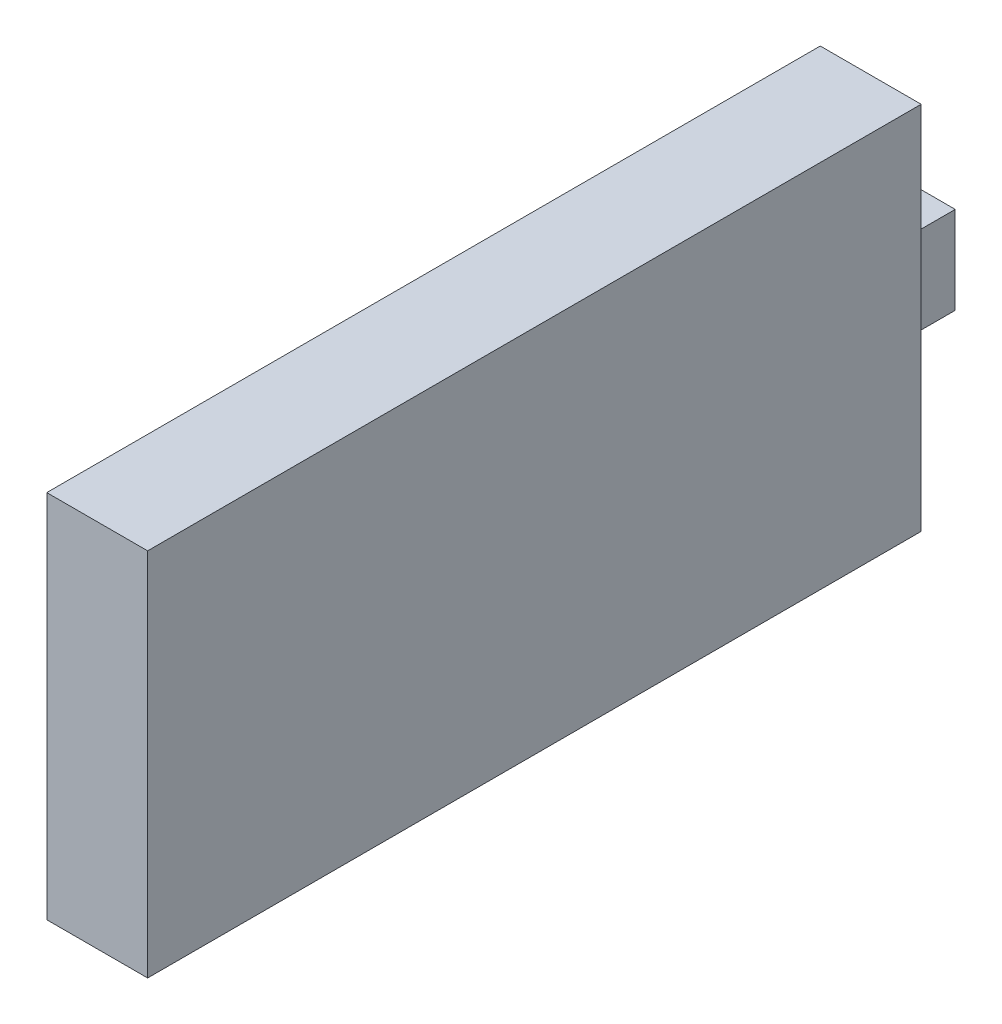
ISO-10303-21;
HEADER;
FILE_DESCRIPTION(('STEP AP214'),'2;1');
FILE_NAME('part.step','',(''),(''),'','','');
FILE_SCHEMA(('AUTOMOTIVE_DESIGN { 1 0 10303 214 1 1 1 1 }'));
ENDSEC;
DATA;
#1=APPLICATION_CONTEXT('core data for automotive mechanical design processes');
#2=APPLICATION_PROTOCOL_DEFINITION('international standard','automotive_design',2000,#1);
#3=PRODUCT_CONTEXT('',#1,'mechanical');
#4=PRODUCT('Part','Part','',(#3));
#5=PRODUCT_RELATED_PRODUCT_CATEGORY('part','',(#4));
#6=PRODUCT_DEFINITION_FORMATION('','',#4);
#7=PRODUCT_DEFINITION_CONTEXT('part definition',#1,'design');
#8=PRODUCT_DEFINITION('design','',#6,#7);
#9=PRODUCT_DEFINITION_SHAPE('','',#8);
#10=(LENGTH_UNIT() NAMED_UNIT(*) SI_UNIT(.MILLI.,.METRE.));
#11=(NAMED_UNIT(*) PLANE_ANGLE_UNIT() SI_UNIT($,.RADIAN.));
#12=(NAMED_UNIT(*) SI_UNIT($,.STERADIAN.) SOLID_ANGLE_UNIT());
#13=UNCERTAINTY_MEASURE_WITH_UNIT(LENGTH_MEASURE(1.E-05),#10,'distance_accuracy_value','');
#14=(GEOMETRIC_REPRESENTATION_CONTEXT(3) GLOBAL_UNCERTAINTY_ASSIGNED_CONTEXT((#13)) GLOBAL_UNIT_ASSIGNED_CONTEXT((#10,
#11,#12)) REPRESENTATION_CONTEXT('',''));
#15=CARTESIAN_POINT('',(0.,0.,0.));
#16=DIRECTION('',(0.,0.,1.));
#17=DIRECTION('',(1.,0.,0.));
#18=AXIS2_PLACEMENT_3D('',#15,#16,#17);
#19=CARTESIAN_POINT('',(-57.0515585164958,55.,-57.5));
#20=DIRECTION('',(0.,0.,1.));
#21=DIRECTION('',(1.,0.,0.));
#22=AXIS2_PLACEMENT_3D('',#19,#20,#21);
#23=PLANE('',#22);
#24=DIRECTION('',(-1.,0.,0.));
#25=VECTOR('',#24,1.);
#26=CARTESIAN_POINT('',(-57.0515585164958,0.,-57.5));
#27=LINE('',#26,#25);
#28=CARTESIAN_POINT('',(-57.0515585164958,0.,-57.5));
#29=VERTEX_POINT('',#28);
#30=CARTESIAN_POINT('',(-72.0515585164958,0.,-57.5));
#31=VERTEX_POINT('',#30);
#32=EDGE_CURVE('E137',#29,#31,#27,.T.);
#33=ORIENTED_EDGE('',*,*,#32,.T.);
#34=DIRECTION('',(0.,-1.,0.));
#35=VECTOR('',#34,1.);
#36=CARTESIAN_POINT('',(-72.0515585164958,55.,-57.5));
#37=LINE('',#36,#35);
#38=CARTESIAN_POINT('',(-72.0515585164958,55.,-57.5));
#39=VERTEX_POINT('',#38);
#40=EDGE_CURVE('E43',#39,#31,#37,.T.);
#41=ORIENTED_EDGE('',*,*,#40,.F.);
#42=DIRECTION('',(-1.,0.,0.));
#43=VECTOR('',#42,1.);
#44=CARTESIAN_POINT('',(-57.0515585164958,55.,-57.5));
#45=LINE('',#44,#43);
#46=CARTESIAN_POINT('',(-57.0515585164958,55.,-57.5));
#47=VERTEX_POINT('',#46);
#48=EDGE_CURVE('E87',#47,#39,#45,.T.);
#49=ORIENTED_EDGE('',*,*,#48,.F.);
#50=DIRECTION('',(0.,-1.,0.));
#51=VECTOR('',#50,1.);
#52=CARTESIAN_POINT('',(-57.0515585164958,55.,-57.5));
#53=LINE('',#52,#51);
#54=EDGE_CURVE('E11',#47,#29,#53,.T.);
#55=ORIENTED_EDGE('',*,*,#54,.T.);
#56=EDGE_LOOP('',(#33,#41,#49,#55));
#57=FACE_BOUND('',#56,.T.);
#58=DIRECTION('',(-1.,0.,0.));
#59=VECTOR('',#58,1.);
#60=CARTESIAN_POINT('',(-61.9817309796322,21.,-57.5));
#61=LINE('',#60,#59);
#62=CARTESIAN_POINT('',(-61.9817309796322,21.,-57.5));
#63=VERTEX_POINT('',#62);
#64=CARTESIAN_POINT('',(-70.9817309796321,21.,-57.5));
#65=VERTEX_POINT('',#64);
#66=EDGE_CURVE('E132',#63,#65,#61,.T.);
#67=ORIENTED_EDGE('',*,*,#66,.F.);
#68=DIRECTION('',(0.,1.,0.));
#69=VECTOR('',#68,1.);
#70=CARTESIAN_POINT('',(-61.9817309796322,21.,-57.5));
#71=LINE('',#70,#69);
#72=CARTESIAN_POINT('',(-61.9817309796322,34.,-57.5));
#73=VERTEX_POINT('',#72);
#74=EDGE_CURVE('E128',#63,#73,#71,.T.);
#75=ORIENTED_EDGE('',*,*,#74,.T.);
#76=DIRECTION('',(-1.,0.,0.));
#77=VECTOR('',#76,1.);
#78=CARTESIAN_POINT('',(-61.9817309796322,34.,-57.5));
#79=LINE('',#78,#77);
#80=CARTESIAN_POINT('',(-70.9817309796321,34.,-57.5));
#81=VERTEX_POINT('',#80);
#82=EDGE_CURVE('E50',#73,#81,#79,.T.);
#83=ORIENTED_EDGE('',*,*,#82,.T.);
#84=DIRECTION('',(0.,1.,0.));
#85=VECTOR('',#84,1.);
#86=CARTESIAN_POINT('',(-70.9817309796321,21.,-57.5));
#87=LINE('',#86,#85);
#88=EDGE_CURVE('E186',#65,#81,#87,.T.);
#89=ORIENTED_EDGE('',*,*,#88,.F.);
#90=EDGE_LOOP('',(#67,#75,#83,#89));
#91=FACE_BOUND('',#90,.T.);
#92=ADVANCED_FACE('F35',(#57,#91),#23,.F.);
#93=CARTESIAN_POINT('',(-57.0515585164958,55.,-57.5));
#94=DIRECTION('',(-1.,0.,0.));
#95=DIRECTION('',(0.,0.,1.));
#96=AXIS2_PLACEMENT_3D('',#93,#94,#95);
#97=PLANE('',#96);
#98=DIRECTION('',(0.,0.,-1.));
#99=VECTOR('',#98,1.);
#100=CARTESIAN_POINT('',(-57.0515585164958,0.,-57.5));
#101=LINE('',#100,#99);
#102=CARTESIAN_POINT('',(-57.0515585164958,0.,57.5));
#103=VERTEX_POINT('',#102);
#104=EDGE_CURVE('E134',#103,#29,#101,.T.);
#105=ORIENTED_EDGE('',*,*,#104,.T.);
#106=ORIENTED_EDGE('',*,*,#54,.F.);
#107=DIRECTION('',(0.,0.,-1.));
#108=VECTOR('',#107,1.);
#109=CARTESIAN_POINT('',(-57.0515585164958,55.,-57.5));
#110=LINE('',#109,#108);
#111=CARTESIAN_POINT('',(-57.0515585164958,55.,57.5));
#112=VERTEX_POINT('',#111);
#113=EDGE_CURVE('E143',#112,#47,#110,.T.);
#114=ORIENTED_EDGE('',*,*,#113,.F.);
#115=DIRECTION('',(0.,-1.,0.));
#116=VECTOR('',#115,1.);
#117=CARTESIAN_POINT('',(-57.0515585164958,55.,57.5));
#118=LINE('',#117,#116);
#119=EDGE_CURVE('E148',#112,#103,#118,.T.);
#120=ORIENTED_EDGE('',*,*,#119,.T.);
#121=EDGE_LOOP('',(#105,#106,#114,#120));
#122=FACE_BOUND('',#121,.T.);
#123=ADVANCED_FACE('F37',(#122),#97,.F.);
#124=CARTESIAN_POINT('',(-72.0515585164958,55.,-57.5));
#125=DIRECTION('',(1.,0.,0.));
#126=DIRECTION('',(0.,0.,-1.));
#127=AXIS2_PLACEMENT_3D('',#124,#125,#126);
#128=PLANE('',#127);
#129=DIRECTION('',(0.,0.,1.));
#130=VECTOR('',#129,1.);
#131=CARTESIAN_POINT('',(-72.0515585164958,0.,-57.5));
#132=LINE('',#131,#130);
#133=CARTESIAN_POINT('',(-72.0515585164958,0.,57.5));
#134=VERTEX_POINT('',#133);
#135=EDGE_CURVE('E151',#31,#134,#132,.T.);
#136=ORIENTED_EDGE('',*,*,#135,.T.);
#137=DIRECTION('',(0.,-1.,0.));
#138=VECTOR('',#137,1.);
#139=CARTESIAN_POINT('',(-72.0515585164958,55.,57.5));
#140=LINE('',#139,#138);
#141=CARTESIAN_POINT('',(-72.0515585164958,55.,57.5));
#142=VERTEX_POINT('',#141);
#143=EDGE_CURVE('E155',#142,#134,#140,.T.);
#144=ORIENTED_EDGE('',*,*,#143,.F.);
#145=DIRECTION('',(0.,0.,1.));
#146=VECTOR('',#145,1.);
#147=CARTESIAN_POINT('',(-72.0515585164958,55.,-57.5));
#148=LINE('',#147,#146);
#149=EDGE_CURVE('E146',#39,#142,#148,.T.);
#150=ORIENTED_EDGE('',*,*,#149,.F.);
#151=ORIENTED_EDGE('',*,*,#40,.T.);
#152=EDGE_LOOP('',(#136,#144,#150,#151));
#153=FACE_BOUND('',#152,.T.);
#154=ADVANCED_FACE('F160',(#153),#128,.F.);
#155=CARTESIAN_POINT('',(-57.0515585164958,55.,57.5));
#156=DIRECTION('',(0.,0.,-1.));
#157=DIRECTION('',(-1.,0.,0.));
#158=AXIS2_PLACEMENT_3D('',#155,#156,#157);
#159=PLANE('',#158);
#160=DIRECTION('',(1.,0.,0.));
#161=VECTOR('',#160,1.);
#162=CARTESIAN_POINT('',(-57.0515585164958,0.,57.5));
#163=LINE('',#162,#161);
#164=EDGE_CURVE('E80',#134,#103,#163,.T.);
#165=ORIENTED_EDGE('',*,*,#164,.T.);
#166=ORIENTED_EDGE('',*,*,#119,.F.);
#167=DIRECTION('',(1.,0.,0.));
#168=VECTOR('',#167,1.);
#169=CARTESIAN_POINT('',(-57.0515585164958,55.,57.5));
#170=LINE('',#169,#168);
#171=EDGE_CURVE('E59',#142,#112,#170,.T.);
#172=ORIENTED_EDGE('',*,*,#171,.F.);
#173=ORIENTED_EDGE('',*,*,#143,.T.);
#174=EDGE_LOOP('',(#165,#166,#172,#173));
#175=FACE_BOUND('',#174,.T.);
#176=ADVANCED_FACE('F168',(#175),#159,.F.);
#177=CARTESIAN_POINT('',(0.,55.,0.));
#178=DIRECTION('',(0.,-1.,0.));
#179=DIRECTION('',(0.,0.,-1.));
#180=AXIS2_PLACEMENT_3D('',#177,#178,#179);
#181=PLANE('',#180);
#182=ORIENTED_EDGE('',*,*,#113,.T.);
#183=ORIENTED_EDGE('',*,*,#48,.T.);
#184=ORIENTED_EDGE('',*,*,#149,.T.);
#185=ORIENTED_EDGE('',*,*,#171,.T.);
#186=EDGE_LOOP('',(#182,#183,#184,#185));
#187=FACE_BOUND('',#186,.T.);
#188=ADVANCED_FACE('F170',(#187),#181,.F.);
#189=CARTESIAN_POINT('',(0.,0.,0.));
#190=DIRECTION('',(0.,-1.,0.));
#191=DIRECTION('',(0.,0.,-1.));
#192=AXIS2_PLACEMENT_3D('',#189,#190,#191);
#193=PLANE('',#192);
#194=ORIENTED_EDGE('',*,*,#104,.F.);
#195=ORIENTED_EDGE('',*,*,#164,.F.);
#196=ORIENTED_EDGE('',*,*,#135,.F.);
#197=ORIENTED_EDGE('',*,*,#32,.F.);
#198=EDGE_LOOP('',(#194,#195,#196,#197));
#199=FACE_BOUND('',#198,.T.);
#200=ADVANCED_FACE('F164',(#199),#193,.T.);
#201=CARTESIAN_POINT('',(-61.9817309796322,21.,-67.5));
#202=DIRECTION('',(0.,1.,0.));
#203=DIRECTION('',(0.,0.,1.));
#204=AXIS2_PLACEMENT_3D('',#201,#202,#203);
#205=PLANE('',#204);
#206=ORIENTED_EDGE('',*,*,#66,.T.);
#207=DIRECTION('',(0.,0.,1.));
#208=VECTOR('',#207,1.);
#209=CARTESIAN_POINT('',(-70.9817309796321,21.,-67.5));
#210=LINE('',#209,#208);
#211=CARTESIAN_POINT('',(-70.9817309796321,21.,-67.5));
#212=VERTEX_POINT('',#211);
#213=EDGE_CURVE('E113',#212,#65,#210,.T.);
#214=ORIENTED_EDGE('',*,*,#213,.F.);
#215=DIRECTION('',(-1.,0.,0.));
#216=VECTOR('',#215,1.);
#217=CARTESIAN_POINT('',(-61.9817309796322,21.,-67.5));
#218=LINE('',#217,#216);
#219=CARTESIAN_POINT('',(-61.9817309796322,21.,-67.5));
#220=VERTEX_POINT('',#219);
#221=EDGE_CURVE('E120',#220,#212,#218,.T.);
#222=ORIENTED_EDGE('',*,*,#221,.F.);
#223=DIRECTION('',(0.,0.,1.));
#224=VECTOR('',#223,1.);
#225=CARTESIAN_POINT('',(-61.9817309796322,21.,-67.5));
#226=LINE('',#225,#224);
#227=EDGE_CURVE('E194',#220,#63,#226,.T.);
#228=ORIENTED_EDGE('',*,*,#227,.T.);
#229=EDGE_LOOP('',(#206,#214,#222,#228));
#230=FACE_BOUND('',#229,.T.);
#231=ADVANCED_FACE('F130',(#230),#205,.F.);
#232=CARTESIAN_POINT('',(-70.9817309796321,21.,-67.5));
#233=DIRECTION('',(1.,0.,0.));
#234=DIRECTION('',(0.,0.,-1.));
#235=AXIS2_PLACEMENT_3D('',#232,#233,#234);
#236=PLANE('',#235);
#237=ORIENTED_EDGE('',*,*,#88,.T.);
#238=DIRECTION('',(0.,0.,1.));
#239=VECTOR('',#238,1.);
#240=CARTESIAN_POINT('',(-70.9817309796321,34.,-67.5));
#241=LINE('',#240,#239);
#242=CARTESIAN_POINT('',(-70.9817309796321,34.,-67.5));
#243=VERTEX_POINT('',#242);
#244=EDGE_CURVE('E115',#243,#81,#241,.T.);
#245=ORIENTED_EDGE('',*,*,#244,.F.);
#246=DIRECTION('',(0.,1.,0.));
#247=VECTOR('',#246,1.);
#248=CARTESIAN_POINT('',(-70.9817309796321,21.,-67.5));
#249=LINE('',#248,#247);
#250=EDGE_CURVE('E108',#212,#243,#249,.T.);
#251=ORIENTED_EDGE('',*,*,#250,.F.);
#252=ORIENTED_EDGE('',*,*,#213,.T.);
#253=EDGE_LOOP('',(#237,#245,#251,#252));
#254=FACE_BOUND('',#253,.T.);
#255=ADVANCED_FACE('F111',(#254),#236,.F.);
#256=CARTESIAN_POINT('',(-61.9817309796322,34.,-67.5));
#257=DIRECTION('',(0.,1.,0.));
#258=DIRECTION('',(-1.,0.,0.));
#259=AXIS2_PLACEMENT_3D('',#256,#257,#258);
#260=PLANE('',#259);
#261=ORIENTED_EDGE('',*,*,#82,.F.);
#262=DIRECTION('',(0.,0.,1.));
#263=VECTOR('',#262,1.);
#264=CARTESIAN_POINT('',(-61.9817309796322,34.,-67.5));
#265=LINE('',#264,#263);
#266=CARTESIAN_POINT('',(-61.9817309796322,34.,-67.5));
#267=VERTEX_POINT('',#266);
#268=EDGE_CURVE('E139',#267,#73,#265,.T.);
#269=ORIENTED_EDGE('',*,*,#268,.F.);
#270=DIRECTION('',(-1.,0.,0.));
#271=VECTOR('',#270,1.);
#272=CARTESIAN_POINT('',(-61.9817309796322,34.,-67.5));
#273=LINE('',#272,#271);
#274=EDGE_CURVE('E119',#267,#243,#273,.T.);
#275=ORIENTED_EDGE('',*,*,#274,.T.);
#276=ORIENTED_EDGE('',*,*,#244,.T.);
#277=EDGE_LOOP('',(#261,#269,#275,#276));
#278=FACE_BOUND('',#277,.T.);
#279=ADVANCED_FACE('F197',(#278),#260,.T.);
#280=CARTESIAN_POINT('',(-61.9817309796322,21.,-67.5));
#281=DIRECTION('',(1.,0.,0.));
#282=DIRECTION('',(0.,0.,-1.));
#283=AXIS2_PLACEMENT_3D('',#280,#281,#282);
#284=PLANE('',#283);
#285=ORIENTED_EDGE('',*,*,#74,.F.);
#286=ORIENTED_EDGE('',*,*,#227,.F.);
#287=DIRECTION('',(0.,1.,0.));
#288=VECTOR('',#287,1.);
#289=CARTESIAN_POINT('',(-61.9817309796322,21.,-67.5));
#290=LINE('',#289,#288);
#291=EDGE_CURVE('E126',#220,#267,#290,.T.);
#292=ORIENTED_EDGE('',*,*,#291,.T.);
#293=ORIENTED_EDGE('',*,*,#268,.T.);
#294=EDGE_LOOP('',(#285,#286,#292,#293));
#295=FACE_BOUND('',#294,.T.);
#296=ADVANCED_FACE('F196',(#295),#284,.T.);
#297=CARTESIAN_POINT('',(0.,0.,-67.5));
#298=DIRECTION('',(0.,0.,-1.));
#299=DIRECTION('',(-1.,0.,0.));
#300=AXIS2_PLACEMENT_3D('',#297,#298,#299);
#301=PLANE('',#300);
#302=ORIENTED_EDGE('',*,*,#221,.T.);
#303=ORIENTED_EDGE('',*,*,#250,.T.);
#304=ORIENTED_EDGE('',*,*,#274,.F.);
#305=ORIENTED_EDGE('',*,*,#291,.F.);
#306=EDGE_LOOP('',(#302,#303,#304,#305));
#307=FACE_BOUND('',#306,.T.);
#308=ADVANCED_FACE('F124',(#307),#301,.T.);
#309=CLOSED_SHELL('',(#92,#123,#154,#176,#188,#200,#231,#255,#279,#296,#308));
#310=MANIFOLD_SOLID_BREP('B2',#309);
#311=ADVANCED_BREP_SHAPE_REPRESENTATION('',(#18,#310),#14);
#312=SHAPE_DEFINITION_REPRESENTATION(#9,#311);
ENDSEC;
END-ISO-10303-21;
